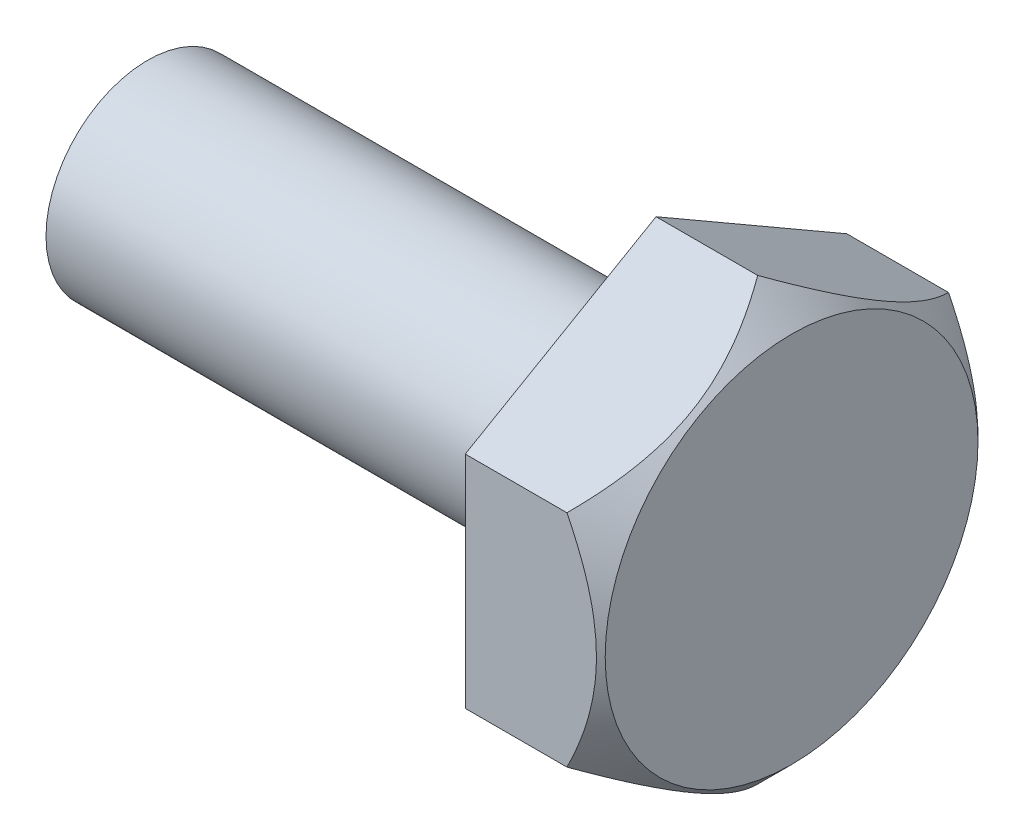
ISO-10303-21;
HEADER;
FILE_DESCRIPTION(('STEP AP214'),'2;1');
FILE_NAME('part.step','',(''),(''),'','','');
FILE_SCHEMA(('AUTOMOTIVE_DESIGN { 1 0 10303 214 1 1 1 1 }'));
ENDSEC;
DATA;
#1=APPLICATION_CONTEXT('core data for automotive mechanical design processes');
#2=APPLICATION_PROTOCOL_DEFINITION('international standard','automotive_design',2000,#1);
#3=PRODUCT_CONTEXT('',#1,'mechanical');
#4=PRODUCT('Part','Part','',(#3));
#5=PRODUCT_RELATED_PRODUCT_CATEGORY('part','',(#4));
#6=PRODUCT_DEFINITION_FORMATION('','',#4);
#7=PRODUCT_DEFINITION_CONTEXT('part definition',#1,'design');
#8=PRODUCT_DEFINITION('design','',#6,#7);
#9=PRODUCT_DEFINITION_SHAPE('','',#8);
#10=(LENGTH_UNIT() NAMED_UNIT(*) SI_UNIT(.MILLI.,.METRE.));
#11=(NAMED_UNIT(*) PLANE_ANGLE_UNIT() SI_UNIT($,.RADIAN.));
#12=(NAMED_UNIT(*) SI_UNIT($,.STERADIAN.) SOLID_ANGLE_UNIT());
#13=UNCERTAINTY_MEASURE_WITH_UNIT(LENGTH_MEASURE(1.E-05),#10,'distance_accuracy_value','');
#14=(GEOMETRIC_REPRESENTATION_CONTEXT(3) GLOBAL_UNCERTAINTY_ASSIGNED_CONTEXT((#13)) GLOBAL_UNIT_ASSIGNED_CONTEXT((#10,
#11,#12)) REPRESENTATION_CONTEXT('',''));
#15=CARTESIAN_POINT('',(0.,0.,0.));
#16=DIRECTION('',(0.,0.,1.));
#17=DIRECTION('',(1.,0.,0.));
#18=AXIS2_PLACEMENT_3D('',#15,#16,#17);
#19=CARTESIAN_POINT('',(-4.,3.,0.));
#20=DIRECTION('',(1.,0.,0.));
#21=DIRECTION('',(0.,0.,-1.));
#22=AXIS2_PLACEMENT_3D('',#19,#20,#21);
#23=PLANE('',#22);
#24=CARTESIAN_POINT('',(-4.,0.,0.));
#25=DIRECTION('',(-1.,0.,0.));
#26=DIRECTION('',(0.,0.,1.));
#27=AXIS2_PLACEMENT_3D('',#24,#25,#26);
#28=CIRCLE('',#27,3.);
#29=CARTESIAN_POINT('',(-4.,0.,3.));
#30=VERTEX_POINT('',#29);
#31=EDGE_CURVE('E117',#30,#30,#28,.T.);
#32=ORIENTED_EDGE('',*,*,#31,.F.);
#33=EDGE_LOOP('',(#32));
#34=FACE_BOUND('',#33,.T.);
#35=DIRECTION('',(0.,0.499999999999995,0.866025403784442));
#36=VECTOR('',#35,1.);
#37=CARTESIAN_POINT('',(-4.,5.62500000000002,-1.51554445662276));
#38=LINE('',#37,#36);
#39=CARTESIAN_POINT('',(-4.,3.25000000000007,-5.62916512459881));
#40=VERTEX_POINT('',#39);
#41=CARTESIAN_POINT('',(-4.,6.5,0.));
#42=VERTEX_POINT('',#41);
#43=EDGE_CURVE('E115',#40,#42,#38,.T.);
#44=ORIENTED_EDGE('',*,*,#43,.F.);
#45=DIRECTION('',(0.,1.,0.));
#46=VECTOR('',#45,1.);
#47=CARTESIAN_POINT('',(-4.,3.00000000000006,-5.62916512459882));
#48=LINE('',#47,#46);
#49=CARTESIAN_POINT('',(-4.,-3.24999999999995,-5.62916512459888));
#50=VERTEX_POINT('',#49);
#51=EDGE_CURVE('E113',#50,#40,#48,.T.);
#52=ORIENTED_EDGE('',*,*,#51,.F.);
#53=DIRECTION('',(0.,0.500000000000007,-0.866025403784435));
#54=VECTOR('',#53,1.);
#55=CARTESIAN_POINT('',(-4.,-4.12499999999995,-4.11362066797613));
#56=LINE('',#55,#54);
#57=CARTESIAN_POINT('',(-4.,-6.5,0.));
#58=VERTEX_POINT('',#57);
#59=EDGE_CURVE('E108',#58,#50,#56,.T.);
#60=ORIENTED_EDGE('',*,*,#59,.F.);
#61=DIRECTION('',(0.,-0.499999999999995,-0.866025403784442));
#62=VECTOR('',#61,1.);
#63=CARTESIAN_POINT('',(-4.,-4.12500000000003,4.11362066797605));
#64=LINE('',#63,#62);
#65=CARTESIAN_POINT('',(-4.,-3.25000000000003,5.62916512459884));
#66=VERTEX_POINT('',#65);
#67=EDGE_CURVE('E106',#66,#58,#64,.T.);
#68=ORIENTED_EDGE('',*,*,#67,.F.);
#69=DIRECTION('',(0.,-1.,0.));
#70=VECTOR('',#69,1.);
#71=CARTESIAN_POINT('',(-4.,2.99999999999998,5.62916512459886));
#72=LINE('',#71,#70);
#73=CARTESIAN_POINT('',(-4.,3.24999999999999,5.62916512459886));
#74=VERTEX_POINT('',#73);
#75=EDGE_CURVE('E92',#74,#66,#72,.T.);
#76=ORIENTED_EDGE('',*,*,#75,.F.);
#77=DIRECTION('',(0.,-0.500000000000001,0.866025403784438));
#78=VECTOR('',#77,1.);
#79=CARTESIAN_POINT('',(-4.,5.625,1.51554445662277));
#80=LINE('',#79,#78);
#81=EDGE_CURVE('E87',#42,#74,#80,.T.);
#82=ORIENTED_EDGE('',*,*,#81,.F.);
#83=EDGE_LOOP('',(#44,#52,#60,#68,#76,#82));
#84=FACE_BOUND('',#83,.T.);
#85=ADVANCED_FACE('F32',(#34,#84),#23,.F.);
#86=CARTESIAN_POINT('',(-19.,0.,0.));
#87=DIRECTION('',(1.,0.,0.));
#88=DIRECTION('',(0.,0.,-1.));
#89=AXIS2_PLACEMENT_3D('',#86,#87,#88);
#90=PLANE('',#89);
#91=CARTESIAN_POINT('',(-19.,0.,0.));
#92=DIRECTION('',(-1.,0.,0.));
#93=DIRECTION('',(0.,0.,1.));
#94=AXIS2_PLACEMENT_3D('',#91,#92,#93);
#95=CIRCLE('',#94,3.);
#96=CARTESIAN_POINT('',(-19.,0.,3.));
#97=VERTEX_POINT('',#96);
#98=EDGE_CURVE('E120',#97,#97,#95,.T.);
#99=ORIENTED_EDGE('',*,*,#98,.T.);
#100=EDGE_LOOP('',(#99));
#101=FACE_BOUND('',#100,.T.);
#102=ADVANCED_FACE('F151',(#101),#90,.F.);
#103=CARTESIAN_POINT('',(0.,0.,0.));
#104=DIRECTION('',(-1.,0.,0.));
#105=DIRECTION('',(0.,0.,1.));
#106=AXIS2_PLACEMENT_3D('',#103,#104,#105);
#107=CYLINDRICAL_SURFACE('',#106,3.);
#108=ORIENTED_EDGE('',*,*,#98,.F.);
#109=EDGE_LOOP('',(#108));
#110=FACE_BOUND('',#109,.T.);
#111=ORIENTED_EDGE('',*,*,#31,.T.);
#112=EDGE_LOOP('',(#111));
#113=FACE_BOUND('',#112,.T.);
#114=ADVANCED_FACE('F147',(#110,#113),#107,.T.);
#115=CARTESIAN_POINT('',(-10.,3.25000000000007,-5.62916512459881));
#116=DIRECTION('',(0.,0.866025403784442,-0.499999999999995));
#117=DIRECTION('',(0.,0.499999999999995,0.866025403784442));
#118=AXIS2_PLACEMENT_3D('',#115,#116,#117);
#119=PLANE('',#118);
#120=ORIENTED_EDGE('',*,*,#43,.T.);
#121=DIRECTION('',(1.,0.,0.));
#122=VECTOR('',#121,1.);
#123=CARTESIAN_POINT('',(-10.,6.5,0.));
#124=LINE('',#123,#122);
#125=CARTESIAN_POINT('',(-1.,6.5,0.));
#126=VERTEX_POINT('',#125);
#127=EDGE_CURVE('E52',#42,#126,#124,.T.);
#128=ORIENTED_EDGE('',*,*,#127,.T.);
#129=CARTESIAN_POINT('',(-1.00011547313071,3.24988452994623,-5.62936512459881));
#130=CARTESIAN_POINT('',(-0.94423902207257,3.30576639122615,-5.53257490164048));
#131=CARTESIAN_POINT('',(-0.890077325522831,3.36207778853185,-5.4350407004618));
#132=CARTESIAN_POINT('',(-0.785705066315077,3.47564392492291,-5.23833838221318));
#133=CARTESIAN_POINT('',(-0.735496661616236,3.53289915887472,-5.13916940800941));
#134=CARTESIAN_POINT('',(-0.591155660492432,3.70673894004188,-4.83807007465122));
#135=CARTESIAN_POINT('',(-0.503923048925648,3.82479513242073,-4.63359075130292));
#136=CARTESIAN_POINT('',(-0.354543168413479,4.06286489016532,-4.22124183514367));
#137=CARTESIAN_POINT('',(-0.292019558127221,4.18281760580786,-4.01347763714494));
#138=CARTESIAN_POINT('',(-0.219695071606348,4.36471875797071,-3.69841559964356));
#139=CARTESIAN_POINT('',(-0.199173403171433,4.42562028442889,-3.59293106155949));
#140=CARTESIAN_POINT('',(-0.16574809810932,4.54793900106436,-3.38106882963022));
#141=CARTESIAN_POINT('',(-0.152843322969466,4.60935611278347,-3.2746912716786));
#142=CARTESIAN_POINT('',(-0.131206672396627,4.75902065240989,-3.01546468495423));
#143=CARTESIAN_POINT('',(-0.126666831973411,4.84742933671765,-2.86233635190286));
#144=CARTESIAN_POINT('',(-0.134286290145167,5.0240873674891,-2.55635566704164));
#145=CARTESIAN_POINT('',(-0.146451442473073,5.11233664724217,-2.40350343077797));
#146=CARTESIAN_POINT('',(-0.186763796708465,5.28800321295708,-2.0992400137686));
#147=CARTESIAN_POINT('',(-0.214928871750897,5.37541945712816,-1.94783063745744));
#148=CARTESIAN_POINT('',(-0.285709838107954,5.54874947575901,-1.64761423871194));
#149=CARTESIAN_POINT('',(-0.328324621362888,5.63466336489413,-1.49880701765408));
#150=CARTESIAN_POINT('',(-0.415996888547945,5.78717685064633,-1.23464591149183));
#151=CARTESIAN_POINT('',(-0.45874873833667,5.85411414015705,-1.11870712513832));
#152=CARTESIAN_POINT('',(-0.551141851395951,5.98678709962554,-0.888910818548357));
#153=CARTESIAN_POINT('',(-0.600783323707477,6.05252273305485,-0.775053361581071));
#154=CARTESIAN_POINT('',(-0.705842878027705,6.18258533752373,-0.549778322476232));
#155=CARTESIAN_POINT('',(-0.761242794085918,6.2469160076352,-0.438354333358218));
#156=CARTESIAN_POINT('',(-0.87709187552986,6.37438610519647,-0.217569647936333));
#157=CARTESIAN_POINT('',(-0.937537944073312,6.43752623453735,-0.108207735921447));
#158=CARTESIAN_POINT('',(-1.00011547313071,6.50011547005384,0.000199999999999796));
#159=B_SPLINE_CURVE_WITH_KNOTS('',3,(#129,#130,#131,#132,#133,#134,#135,#136,#137,#138,#139,
#140,#141,#142,#143,#144,#145,#146,#147,#148,#149,#150,#151,#152,#153,#154,#155,#156,#157,#158),
.UNSPECIFIED.,.F.,.F.,(4,2,2,2,2,2,2,2,2,2,2,2,2,2,4),(0.,0.374837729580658,0.749878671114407,
1.50400966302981,2.24616559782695,2.61651570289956,2.98681043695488,3.51661288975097,
4.04660104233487,4.57718239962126,5.10772307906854,5.52913066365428,5.9505510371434,
6.37068015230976,6.79055330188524),.UNSPECIFIED.);
#160=CARTESIAN_POINT('',(-1.,3.25000000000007,-5.62916512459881));
#161=VERTEX_POINT('',#160);
#162=EDGE_CURVE('E12',#161,#126,#159,.T.);
#163=ORIENTED_EDGE('',*,*,#162,.F.);
#164=DIRECTION('',(1.,0.,0.));
#165=VECTOR('',#164,1.);
#166=CARTESIAN_POINT('',(-10.,3.25000000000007,-5.62916512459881));
#167=LINE('',#166,#165);
#168=EDGE_CURVE('E93',#40,#161,#167,.T.);
#169=ORIENTED_EDGE('',*,*,#168,.F.);
#170=EDGE_LOOP('',(#120,#128,#163,#169));
#171=FACE_BOUND('',#170,.T.);
#172=ADVANCED_FACE('F142',(#171),#119,.T.);
#173=CARTESIAN_POINT('',(-10.,-3.24999999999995,-5.62916512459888));
#174=DIRECTION('',(0.,0.,-1.));
#175=DIRECTION('',(0.,1.,0.));
#176=AXIS2_PLACEMENT_3D('',#173,#174,#175);
#177=PLANE('',#176);
#178=ORIENTED_EDGE('',*,*,#51,.T.);
#179=ORIENTED_EDGE('',*,*,#168,.T.);
#180=CARTESIAN_POINT('',(-3.27419536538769,-6.73045349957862,-5.62916512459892));
#181=CARTESIAN_POINT('',(-3.1493384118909,-6.56764635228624,-5.62916512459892));
#182=CARTESIAN_POINT('',(-3.02561479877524,-6.40395608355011,-5.62916512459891));
#183=CARTESIAN_POINT('',(-2.78095028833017,-6.0744504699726,-5.62916512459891));
#184=CARTESIAN_POINT('',(-2.66001006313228,-5.90863462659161,-5.62916512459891));
#185=CARTESIAN_POINT('',(-2.42056758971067,-5.57330676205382,-5.6291651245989));
#186=CARTESIAN_POINT('',(-2.3020913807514,-5.40377608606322,-5.6291651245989));
#187=CARTESIAN_POINT('',(-2.06931142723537,-5.06188319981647,-5.6291651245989));
#188=CARTESIAN_POINT('',(-1.95500739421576,-4.88952118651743,-5.6291651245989));
#189=CARTESIAN_POINT('',(-1.72455454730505,-4.53064916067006,-5.6291651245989));
#190=CARTESIAN_POINT('',(-1.60873467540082,-4.34392684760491,-5.62916512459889));
#191=CARTESIAN_POINT('',(-1.3843551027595,-3.96610092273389,-5.62916512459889));
#192=CARTESIAN_POINT('',(-1.27579661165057,-3.77499658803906,-5.62916512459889));
#193=CARTESIAN_POINT('',(-1.06825702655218,-3.38836628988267,-5.62916512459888));
#194=CARTESIAN_POINT('',(-0.969247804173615,-3.19285554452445,-5.62916512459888));
#195=CARTESIAN_POINT('',(-0.783024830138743,-2.79633950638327,-5.62916512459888));
#196=CARTESIAN_POINT('',(-0.695805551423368,-2.59533684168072,-5.62916512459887));
#197=CARTESIAN_POINT('',(-0.543946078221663,-2.20693844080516,-5.62916512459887));
#198=CARTESIAN_POINT('',(-0.477944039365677,-2.02008065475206,-5.62916512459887));
#199=CARTESIAN_POINT('',(-0.360901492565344,-1.64164893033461,-5.62916512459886));
#200=CARTESIAN_POINT('',(-0.309861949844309,-1.45007468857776,-5.62916512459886));
#201=CARTESIAN_POINT('',(-0.226340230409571,-1.0666642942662,-5.62916512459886));
#202=CARTESIAN_POINT('',(-0.193524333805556,-0.874902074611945,-5.62916512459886));
#203=CARTESIAN_POINT('',(-0.147126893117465,-0.489051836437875,-5.62916512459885));
#204=CARTESIAN_POINT('',(-0.133541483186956,-0.294964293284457,-5.62916512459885));
#205=CARTESIAN_POINT('',(-0.126737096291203,0.0853451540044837,-5.62916512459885));
#206=CARTESIAN_POINT('',(-0.13268036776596,0.271552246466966,-5.62916512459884));
#207=CARTESIAN_POINT('',(-0.162693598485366,0.642489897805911,-5.62916512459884));
#208=CARTESIAN_POINT('',(-0.186765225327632,0.827220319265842,-5.62916512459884));
#209=CARTESIAN_POINT('',(-0.25209148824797,1.19699673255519,-5.62916512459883));
#210=CARTESIAN_POINT('',(-0.293647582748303,1.38198856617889,-5.62916512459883));
#211=CARTESIAN_POINT('',(-0.391652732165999,1.74790655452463,-5.62916512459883));
#212=CARTESIAN_POINT('',(-0.448100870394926,1.92883295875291,-5.62916512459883));
#213=CARTESIAN_POINT('',(-0.57740433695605,2.29761840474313,-5.62916512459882));
#214=CARTESIAN_POINT('',(-0.651073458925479,2.4851889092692,-5.62916512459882));
#215=CARTESIAN_POINT('',(-0.80978292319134,2.85549848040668,-5.62916512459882));
#216=CARTESIAN_POINT('',(-0.894828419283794,3.03823531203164,-5.62916512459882));
#217=CARTESIAN_POINT('',(-1.0742729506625,3.39974500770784,-5.62916512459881));
#218=CARTESIAN_POINT('',(-1.16870088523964,3.57850340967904,-5.62916512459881));
#219=CARTESIAN_POINT('',(-1.36483089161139,3.93192150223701,-5.62916512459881));
#220=CARTESIAN_POINT('',(-1.46653183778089,4.10658182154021,-5.6291651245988));
#221=CARTESIAN_POINT('',(-1.67061481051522,4.44379608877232,-5.6291651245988));
#222=CARTESIAN_POINT('',(-1.77271468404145,4.60652170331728,-5.6291651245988));
#223=CARTESIAN_POINT('',(-1.98125285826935,4.92917744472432,-5.6291651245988));
#224=CARTESIAN_POINT('',(-2.08769148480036,5.0891073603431,-5.62916512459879));
#225=CARTESIAN_POINT('',(-2.30326475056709,5.405249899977,-5.62916512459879));
#226=CARTESIAN_POINT('',(-2.41237081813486,5.5614820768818,-5.62916512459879));
#227=CARTESIAN_POINT('',(-2.63350206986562,5.87180427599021,-5.62916512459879));
#228=CARTESIAN_POINT('',(-2.74552644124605,6.02589487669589,-5.62916512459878));
#229=CARTESIAN_POINT('',(-2.85874514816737,6.17908734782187,-5.62916512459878));
#230=B_SPLINE_CURVE_WITH_KNOTS('',3,(#180,#181,#182,#183,#184,#185,#186,#187,#188,#189,#190,
#191,#192,#193,#194,#195,#196,#197,#198,#199,#200,#201,#202,#203,#204,#205,#206,#207,#208,#209,
#210,#211,#212,#213,#214,#215,#216,#217,#218,#219,#220,#221,#222,#223,#224,#225,#226,#227,#228,
#229),.UNSPECIFIED.,.F.,.F.,(4,2,2,2,2,2,2,2,2,2,2,2,2,2,2,2,2,2,2,2,2,2,2,2,4),(0.,
0.615526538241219,1.23120018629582,1.85162829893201,2.47201343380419,3.13105980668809,
3.79021569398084,4.4473665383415,5.10420823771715,5.69820994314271,6.29224995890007,
6.87501911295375,7.45767109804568,8.0156599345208,8.57370010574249,9.14178375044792,
9.7098324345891,10.3139245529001,10.918291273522,11.5245809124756,12.130776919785,
12.7070087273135,13.2832838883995,13.8549237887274,14.4264061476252),.UNSPECIFIED.);
#231=CARTESIAN_POINT('',(-1.,-3.24999999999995,-5.62916512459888));
#232=VERTEX_POINT('',#231);
#233=EDGE_CURVE('E45',#232,#161,#230,.T.);
#234=ORIENTED_EDGE('',*,*,#233,.F.);
#235=DIRECTION('',(1.,0.,0.));
#236=VECTOR('',#235,1.);
#237=CARTESIAN_POINT('',(-10.,-3.24999999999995,-5.62916512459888));
#238=LINE('',#237,#236);
#239=EDGE_CURVE('E203',#50,#232,#238,.T.);
#240=ORIENTED_EDGE('',*,*,#239,.F.);
#241=EDGE_LOOP('',(#178,#179,#234,#240));
#242=FACE_BOUND('',#241,.T.);
#243=ADVANCED_FACE('F146',(#242),#177,.T.);
#244=CARTESIAN_POINT('',(-10.,-6.5,0.));
#245=DIRECTION('',(0.,-0.866025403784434,-0.500000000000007));
#246=DIRECTION('',(0.,0.500000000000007,-0.866025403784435));
#247=AXIS2_PLACEMENT_3D('',#244,#245,#246);
#248=PLANE('',#247);
#249=ORIENTED_EDGE('',*,*,#59,.T.);
#250=ORIENTED_EDGE('',*,*,#239,.T.);
#251=CARTESIAN_POINT('',(-1.00011547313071,-6.50011547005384,0.000199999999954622));
#252=CARTESIAN_POINT('',(-0.944239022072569,-6.44423360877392,-0.0965902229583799));
#253=CARTESIAN_POINT('',(-0.890077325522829,-6.38792221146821,-0.194124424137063));
#254=CARTESIAN_POINT('',(-0.785705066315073,-6.27435607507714,-0.390826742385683));
#255=CARTESIAN_POINT('',(-0.73549666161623,-6.21710084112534,-0.489995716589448));
#256=CARTESIAN_POINT('',(-0.591155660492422,-6.04326105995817,-0.791095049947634));
#257=CARTESIAN_POINT('',(-0.503923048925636,-5.92520486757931,-0.995574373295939));
#258=CARTESIAN_POINT('',(-0.354543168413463,-5.68713510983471,-1.40792328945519));
#259=CARTESIAN_POINT('',(-0.292019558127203,-5.56718239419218,-1.61568748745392));
#260=CARTESIAN_POINT('',(-0.219695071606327,-5.38528124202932,-1.93074952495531));
#261=CARTESIAN_POINT('',(-0.199173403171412,-5.32437971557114,-2.03623406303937));
#262=CARTESIAN_POINT('',(-0.165748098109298,-5.20206099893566,-2.24809629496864));
#263=CARTESIAN_POINT('',(-0.152843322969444,-5.14064388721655,-2.35447385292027));
#264=CARTESIAN_POINT('',(-0.131206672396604,-4.99097934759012,-2.61370043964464));
#265=CARTESIAN_POINT('',(-0.126666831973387,-4.90257066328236,-2.766828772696));
#266=CARTESIAN_POINT('',(-0.134286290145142,-4.7259126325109,-3.07280945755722));
#267=CARTESIAN_POINT('',(-0.146451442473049,-4.63766335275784,-3.22566169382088));
#268=CARTESIAN_POINT('',(-0.186763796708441,-4.46199678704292,-3.52992511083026));
#269=CARTESIAN_POINT('',(-0.214928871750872,-4.37458054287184,-3.68133448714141));
#270=CARTESIAN_POINT('',(-0.285709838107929,-4.20125052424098,-3.9815508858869));
#271=CARTESIAN_POINT('',(-0.328324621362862,-4.11533663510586,-4.13035810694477));
#272=CARTESIAN_POINT('',(-0.41599688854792,-3.96282314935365,-4.39451921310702));
#273=CARTESIAN_POINT('',(-0.458748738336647,-3.89588585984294,-4.51045799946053));
#274=CARTESIAN_POINT('',(-0.551141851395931,-3.76321290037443,-4.7402543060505));
#275=CARTESIAN_POINT('',(-0.60078332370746,-3.69747726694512,-4.85411176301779));
#276=CARTESIAN_POINT('',(-0.705842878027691,-3.56741466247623,-5.07938680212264));
#277=CARTESIAN_POINT('',(-0.761242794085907,-3.50308399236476,-5.19081079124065));
#278=CARTESIAN_POINT('',(-0.877091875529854,-3.37561389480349,-5.41159547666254));
#279=CARTESIAN_POINT('',(-0.937537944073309,-3.3124737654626,-5.52095738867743));
#280=CARTESIAN_POINT('',(-1.00011547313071,-3.24988452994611,-5.62936512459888));
#281=B_SPLINE_CURVE_WITH_KNOTS('',3,(#251,#252,#253,#254,#255,#256,#257,#258,#259,#260,#261,
#262,#263,#264,#265,#266,#267,#268,#269,#270,#271,#272,#273,#274,#275,#276,#277,#278,#279,#280),
.UNSPECIFIED.,.F.,.F.,(4,2,2,2,2,2,2,2,2,2,2,2,2,2,4),(0.,0.374837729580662,0.749878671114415,
1.50400966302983,2.24616559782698,2.61651570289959,2.98681043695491,3.51661288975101,
4.0466010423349,4.57718239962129,5.10772307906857,5.52913066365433,5.95055103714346,
6.37068015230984,6.79055330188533),.UNSPECIFIED.);
#282=CARTESIAN_POINT('',(-1.,-6.5,0.));
#283=VERTEX_POINT('',#282);
#284=EDGE_CURVE('E169',#283,#232,#281,.T.);
#285=ORIENTED_EDGE('',*,*,#284,.F.);
#286=DIRECTION('',(1.,0.,0.));
#287=VECTOR('',#286,1.);
#288=CARTESIAN_POINT('',(-10.,-6.5,0.));
#289=LINE('',#288,#287);
#290=EDGE_CURVE('E200',#58,#283,#289,.T.);
#291=ORIENTED_EDGE('',*,*,#290,.F.);
#292=EDGE_LOOP('',(#249,#250,#285,#291));
#293=FACE_BOUND('',#292,.T.);
#294=ADVANCED_FACE('F186',(#293),#248,.T.);
#295=CARTESIAN_POINT('',(-10.,-3.25000000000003,5.62916512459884));
#296=DIRECTION('',(0.,-0.866025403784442,0.499999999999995));
#297=DIRECTION('',(0.,-0.499999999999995,-0.866025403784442));
#298=AXIS2_PLACEMENT_3D('',#295,#296,#297);
#299=PLANE('',#298);
#300=ORIENTED_EDGE('',*,*,#67,.T.);
#301=ORIENTED_EDGE('',*,*,#290,.T.);
#302=CARTESIAN_POINT('',(-1.00011547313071,-3.24988452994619,5.62936512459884));
#303=CARTESIAN_POINT('',(-0.944239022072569,-3.30576639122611,5.5325749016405));
#304=CARTESIAN_POINT('',(-0.890077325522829,-3.36207778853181,5.43504070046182));
#305=CARTESIAN_POINT('',(-0.785705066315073,-3.47564392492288,5.23833838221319));
#306=CARTESIAN_POINT('',(-0.73549666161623,-3.53289915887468,5.13916940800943));
#307=CARTESIAN_POINT('',(-0.591155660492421,-3.70673894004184,4.83807007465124));
#308=CARTESIAN_POINT('',(-0.503923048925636,-3.8247951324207,4.63359075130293));
#309=CARTESIAN_POINT('',(-0.354543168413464,-4.06286489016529,4.22124183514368));
#310=CARTESIAN_POINT('',(-0.292019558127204,-4.18281760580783,4.01347763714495));
#311=CARTESIAN_POINT('',(-0.219695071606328,-4.36471875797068,3.69841559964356));
#312=CARTESIAN_POINT('',(-0.199173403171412,-4.42562028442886,3.59293106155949));
#313=CARTESIAN_POINT('',(-0.165748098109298,-4.54793900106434,3.38106882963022));
#314=CARTESIAN_POINT('',(-0.152843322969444,-4.60935611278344,3.27469127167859));
#315=CARTESIAN_POINT('',(-0.131206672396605,-4.75902065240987,3.01546468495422));
#316=CARTESIAN_POINT('',(-0.126666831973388,-4.84742933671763,2.86233635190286));
#317=CARTESIAN_POINT('',(-0.134286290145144,-5.02408736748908,2.55635566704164));
#318=CARTESIAN_POINT('',(-0.14645144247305,-5.11233664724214,2.40350343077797));
#319=CARTESIAN_POINT('',(-0.186763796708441,-5.28800321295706,2.09924001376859));
#320=CARTESIAN_POINT('',(-0.214928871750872,-5.37541945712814,1.94783063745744));
#321=CARTESIAN_POINT('',(-0.285709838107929,-5.54874947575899,1.64761423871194));
#322=CARTESIAN_POINT('',(-0.328324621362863,-5.6346633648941,1.49880701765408));
#323=CARTESIAN_POINT('',(-0.415996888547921,-5.78717685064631,1.23464591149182));
#324=CARTESIAN_POINT('',(-0.458748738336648,-5.85411414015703,1.11870712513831));
#325=CARTESIAN_POINT('',(-0.551141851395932,-5.98678709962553,0.888910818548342));
#326=CARTESIAN_POINT('',(-0.60078332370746,-6.05252273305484,0.775053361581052));
#327=CARTESIAN_POINT('',(-0.705842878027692,-6.18258533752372,0.549778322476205));
#328=CARTESIAN_POINT('',(-0.761242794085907,-6.24691600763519,0.438354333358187));
#329=CARTESIAN_POINT('',(-0.877091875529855,-6.37438610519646,0.217569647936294));
#330=CARTESIAN_POINT('',(-0.93753794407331,-6.43752623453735,0.108207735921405));
#331=CARTESIAN_POINT('',(-1.00011547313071,-6.50011547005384,-0.000200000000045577));
#332=B_SPLINE_CURVE_WITH_KNOTS('',3,(#302,#303,#304,#305,#306,#307,#308,#309,#310,#311,#312,
#313,#314,#315,#316,#317,#318,#319,#320,#321,#322,#323,#324,#325,#326,#327,#328,#329,#330,#331),
.UNSPECIFIED.,.F.,.F.,(4,2,2,2,2,2,2,2,2,2,2,2,2,2,4),(0.,0.374837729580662,0.749878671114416,
1.50400966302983,2.24616559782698,2.61651570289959,2.98681043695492,3.51661288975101,
4.0466010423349,4.57718239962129,5.10772307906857,5.52913066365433,5.95055103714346,
6.37068015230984,6.79055330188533),.UNSPECIFIED.);
#333=CARTESIAN_POINT('',(-1.,-3.25000000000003,5.62916512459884));
#334=VERTEX_POINT('',#333);
#335=EDGE_CURVE('E174',#334,#283,#332,.T.);
#336=ORIENTED_EDGE('',*,*,#335,.F.);
#337=DIRECTION('',(1.,0.,0.));
#338=VECTOR('',#337,1.);
#339=CARTESIAN_POINT('',(-10.,-3.25000000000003,5.62916512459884));
#340=LINE('',#339,#338);
#341=EDGE_CURVE('E102',#66,#334,#340,.T.);
#342=ORIENTED_EDGE('',*,*,#341,.F.);
#343=EDGE_LOOP('',(#300,#301,#336,#342));
#344=FACE_BOUND('',#343,.T.);
#345=ADVANCED_FACE('F189',(#344),#299,.T.);
#346=CARTESIAN_POINT('',(-10.,3.24999999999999,5.62916512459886));
#347=DIRECTION('',(0.,0.,1.));
#348=DIRECTION('',(0.,-1.,0.));
#349=AXIS2_PLACEMENT_3D('',#346,#347,#348);
#350=PLANE('',#349);
#351=ORIENTED_EDGE('',*,*,#75,.T.);
#352=ORIENTED_EDGE('',*,*,#341,.T.);
#353=CARTESIAN_POINT('',(-3.27419536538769,-6.7304534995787,5.62916512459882));
#354=CARTESIAN_POINT('',(-3.1493384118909,-6.56764635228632,5.62916512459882));
#355=CARTESIAN_POINT('',(-3.02561479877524,-6.40395608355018,5.62916512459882));
#356=CARTESIAN_POINT('',(-2.78095028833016,-6.07445046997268,5.62916512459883));
#357=CARTESIAN_POINT('',(-2.66001006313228,-5.90863462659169,5.62916512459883));
#358=CARTESIAN_POINT('',(-2.42056758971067,-5.5733067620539,5.62916512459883));
#359=CARTESIAN_POINT('',(-2.3020913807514,-5.4037760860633,5.62916512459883));
#360=CARTESIAN_POINT('',(-2.06931142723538,-5.06188319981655,5.62916512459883));
#361=CARTESIAN_POINT('',(-1.95500739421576,-4.88952118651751,5.62916512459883));
#362=CARTESIAN_POINT('',(-1.72455454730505,-4.53064916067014,5.62916512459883));
#363=CARTESIAN_POINT('',(-1.60873467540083,-4.34392684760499,5.62916512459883));
#364=CARTESIAN_POINT('',(-1.3843551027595,-3.96610092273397,5.62916512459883));
#365=CARTESIAN_POINT('',(-1.27579661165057,-3.77499658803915,5.62916512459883));
#366=CARTESIAN_POINT('',(-1.06825702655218,-3.38836628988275,5.62916512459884));
#367=CARTESIAN_POINT('',(-0.969247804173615,-3.19285554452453,5.62916512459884));
#368=CARTESIAN_POINT('',(-0.783024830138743,-2.79633950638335,5.62916512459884));
#369=CARTESIAN_POINT('',(-0.695805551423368,-2.5953368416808,5.62916512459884));
#370=CARTESIAN_POINT('',(-0.543946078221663,-2.20693844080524,5.62916512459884));
#371=CARTESIAN_POINT('',(-0.477944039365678,-2.02008065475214,5.62916512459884));
#372=CARTESIAN_POINT('',(-0.360901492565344,-1.64164893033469,5.62916512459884));
#373=CARTESIAN_POINT('',(-0.309861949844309,-1.45007468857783,5.62916512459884));
#374=CARTESIAN_POINT('',(-0.226340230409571,-1.06666429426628,5.62916512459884));
#375=CARTESIAN_POINT('',(-0.193524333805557,-0.874902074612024,5.62916512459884));
#376=CARTESIAN_POINT('',(-0.147126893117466,-0.489051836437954,5.62916512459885));
#377=CARTESIAN_POINT('',(-0.133541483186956,-0.294964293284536,5.62916512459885));
#378=CARTESIAN_POINT('',(-0.126737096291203,0.0853451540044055,5.62916512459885));
#379=CARTESIAN_POINT('',(-0.13268036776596,0.271552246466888,5.62916512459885));
#380=CARTESIAN_POINT('',(-0.162693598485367,0.642489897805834,5.62916512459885));
#381=CARTESIAN_POINT('',(-0.186765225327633,0.827220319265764,5.62916512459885));
#382=CARTESIAN_POINT('',(-0.25209148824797,1.19699673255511,5.62916512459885));
#383=CARTESIAN_POINT('',(-0.293647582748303,1.38198856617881,5.62916512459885));
#384=CARTESIAN_POINT('',(-0.391652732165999,1.74790655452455,5.62916512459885));
#385=CARTESIAN_POINT('',(-0.448100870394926,1.92883295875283,5.62916512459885));
#386=CARTESIAN_POINT('',(-0.577404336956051,2.29761840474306,5.62916512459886));
#387=CARTESIAN_POINT('',(-0.651073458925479,2.48518890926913,5.62916512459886));
#388=CARTESIAN_POINT('',(-0.809782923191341,2.85549848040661,5.62916512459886));
#389=CARTESIAN_POINT('',(-0.894828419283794,3.03823531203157,5.62916512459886));
#390=CARTESIAN_POINT('',(-1.0742729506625,3.39974500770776,5.62916512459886));
#391=CARTESIAN_POINT('',(-1.16870088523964,3.57850340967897,5.62916512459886));
#392=CARTESIAN_POINT('',(-1.36483089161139,3.93192150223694,5.62916512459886));
#393=CARTESIAN_POINT('',(-1.46653183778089,4.10658182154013,5.62916512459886));
#394=CARTESIAN_POINT('',(-1.67061481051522,4.44379608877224,5.62916512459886));
#395=CARTESIAN_POINT('',(-1.77271468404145,4.6065217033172,5.62916512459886));
#396=CARTESIAN_POINT('',(-1.98125285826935,4.92917744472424,5.62916512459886));
#397=CARTESIAN_POINT('',(-2.08769148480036,5.08910736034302,5.62916512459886));
#398=CARTESIAN_POINT('',(-2.30326475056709,5.40524989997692,5.62916512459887));
#399=CARTESIAN_POINT('',(-2.41237081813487,5.56148207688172,5.62916512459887));
#400=CARTESIAN_POINT('',(-2.63350206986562,5.87180427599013,5.62916512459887));
#401=CARTESIAN_POINT('',(-2.74552644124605,6.02589487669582,5.62916512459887));
#402=CARTESIAN_POINT('',(-2.85874514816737,6.1790873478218,5.62916512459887));
#403=B_SPLINE_CURVE_WITH_KNOTS('',3,(#353,#354,#355,#356,#357,#358,#359,#360,#361,#362,#363,
#364,#365,#366,#367,#368,#369,#370,#371,#372,#373,#374,#375,#376,#377,#378,#379,#380,#381,#382,
#383,#384,#385,#386,#387,#388,#389,#390,#391,#392,#393,#394,#395,#396,#397,#398,#399,#400,#401,
#402),.UNSPECIFIED.,.F.,.F.,(4,2,2,2,2,2,2,2,2,2,2,2,2,2,2,2,2,2,2,2,2,2,2,2,4),(0.,
0.615526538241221,1.23120018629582,1.85162829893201,2.47201343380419,3.13105980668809,
3.79021569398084,4.4473665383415,5.10420823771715,5.69820994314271,6.29224995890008,
6.87501911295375,7.45767109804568,8.01565993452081,8.5737001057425,9.14178375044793,
9.70983243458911,10.3139245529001,10.918291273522,11.5245809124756,12.130776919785,
12.7070087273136,13.2832838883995,13.8549237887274,14.4264061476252),.UNSPECIFIED.);
#404=CARTESIAN_POINT('',(-1.,3.24999999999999,5.62916512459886));
#405=VERTEX_POINT('',#404);
#406=EDGE_CURVE('E100',#405,#334,#403,.F.);
#407=ORIENTED_EDGE('',*,*,#406,.F.);
#408=DIRECTION('',(1.,0.,0.));
#409=VECTOR('',#408,1.);
#410=CARTESIAN_POINT('',(-10.,3.24999999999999,5.62916512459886));
#411=LINE('',#410,#409);
#412=EDGE_CURVE('E57',#74,#405,#411,.T.);
#413=ORIENTED_EDGE('',*,*,#412,.F.);
#414=EDGE_LOOP('',(#351,#352,#407,#413));
#415=FACE_BOUND('',#414,.T.);
#416=ADVANCED_FACE('F96',(#415),#350,.T.);
#417=CARTESIAN_POINT('',(-10.,6.5,0.));
#418=DIRECTION('',(0.,0.866025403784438,0.500000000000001));
#419=DIRECTION('',(0.,-0.500000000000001,0.866025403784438));
#420=AXIS2_PLACEMENT_3D('',#417,#418,#419);
#421=PLANE('',#420);
#422=ORIENTED_EDGE('',*,*,#81,.T.);
#423=ORIENTED_EDGE('',*,*,#412,.T.);
#424=CARTESIAN_POINT('',(-1.00011547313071,6.50011547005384,-0.000200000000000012));
#425=CARTESIAN_POINT('',(-0.944239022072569,6.44423360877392,0.0965902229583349));
#426=CARTESIAN_POINT('',(-0.890077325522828,6.38792221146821,0.194124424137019));
#427=CARTESIAN_POINT('',(-0.785705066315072,6.27435607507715,0.390826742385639));
#428=CARTESIAN_POINT('',(-0.73549666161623,6.21710084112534,0.489995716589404));
#429=CARTESIAN_POINT('',(-0.591155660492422,6.04326105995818,0.791095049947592));
#430=CARTESIAN_POINT('',(-0.503923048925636,5.92520486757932,0.995574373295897));
#431=CARTESIAN_POINT('',(-0.354543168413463,5.68713510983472,1.40792328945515));
#432=CARTESIAN_POINT('',(-0.292019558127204,5.56718239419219,1.61568748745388));
#433=CARTESIAN_POINT('',(-0.219695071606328,5.38528124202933,1.93074952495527));
#434=CARTESIAN_POINT('',(-0.199173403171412,5.32437971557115,2.03623406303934));
#435=CARTESIAN_POINT('',(-0.165748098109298,5.20206099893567,2.2480962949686));
#436=CARTESIAN_POINT('',(-0.152843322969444,5.14064388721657,2.35447385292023));
#437=CARTESIAN_POINT('',(-0.131206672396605,4.99097934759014,2.6137004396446));
#438=CARTESIAN_POINT('',(-0.126666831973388,4.90257066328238,2.76682877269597));
#439=CARTESIAN_POINT('',(-0.134286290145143,4.72591263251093,3.07280945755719));
#440=CARTESIAN_POINT('',(-0.14645144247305,4.63766335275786,3.22566169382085));
#441=CARTESIAN_POINT('',(-0.186763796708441,4.46199678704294,3.52992511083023));
#442=CARTESIAN_POINT('',(-0.214928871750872,4.37458054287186,3.68133448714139));
#443=CARTESIAN_POINT('',(-0.285709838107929,4.20125052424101,3.98155088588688));
#444=CARTESIAN_POINT('',(-0.328324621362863,4.11533663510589,4.13035810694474));
#445=CARTESIAN_POINT('',(-0.415996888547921,3.96282314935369,4.394519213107));
#446=CARTESIAN_POINT('',(-0.458748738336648,3.89588585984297,4.51045799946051));
#447=CARTESIAN_POINT('',(-0.551141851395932,3.76321290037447,4.74025430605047));
#448=CARTESIAN_POINT('',(-0.60078332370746,3.69747726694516,4.85411176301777));
#449=CARTESIAN_POINT('',(-0.705842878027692,3.56741466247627,5.07938680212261));
#450=CARTESIAN_POINT('',(-0.761242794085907,3.5030839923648,5.19081079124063));
#451=CARTESIAN_POINT('',(-0.877091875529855,3.37561389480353,5.41159547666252));
#452=CARTESIAN_POINT('',(-0.93753794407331,3.31247376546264,5.52095738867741));
#453=CARTESIAN_POINT('',(-1.00011547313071,3.24988452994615,5.62936512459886));
#454=B_SPLINE_CURVE_WITH_KNOTS('',3,(#424,#425,#426,#427,#428,#429,#430,#431,#432,#433,#434,
#435,#436,#437,#438,#439,#440,#441,#442,#443,#444,#445,#446,#447,#448,#449,#450,#451,#452,#453),
.UNSPECIFIED.,.F.,.F.,(4,2,2,2,2,2,2,2,2,2,2,2,2,2,4),(0.,0.374837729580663,0.749878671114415,
1.50400966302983,2.24616559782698,2.61651570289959,2.98681043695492,3.51661288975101,
4.0466010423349,4.57718239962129,5.10772307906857,5.52913066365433,5.95055103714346,
6.37068015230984,6.79055330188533),.UNSPECIFIED.);
#455=EDGE_CURVE('E126',#126,#405,#454,.T.);
#456=ORIENTED_EDGE('',*,*,#455,.F.);
#457=ORIENTED_EDGE('',*,*,#127,.F.);
#458=EDGE_LOOP('',(#422,#423,#456,#457));
#459=FACE_BOUND('',#458,.T.);
#460=ADVANCED_FACE('F88',(#459),#421,.T.);
#461=CARTESIAN_POINT('',(0.,6.5,0.));
#462=DIRECTION('',(-1.,0.,0.));
#463=DIRECTION('',(0.,0.,1.));
#464=AXIS2_PLACEMENT_3D('',#461,#462,#463);
#465=PLANE('',#464);
#466=CARTESIAN_POINT('',(0.,0.,0.));
#467=DIRECTION('',(-1.,0.,0.));
#468=DIRECTION('',(0.,0.,1.));
#469=AXIS2_PLACEMENT_3D('',#466,#467,#468);
#470=CIRCLE('',#469,5.5);
#471=CARTESIAN_POINT('',(0.,0.,5.5));
#472=VERTEX_POINT('',#471);
#473=EDGE_CURVE('E123',#472,#472,#470,.F.);
#474=ORIENTED_EDGE('',*,*,#473,.T.);
#475=EDGE_LOOP('',(#474));
#476=FACE_BOUND('',#475,.T.);
#477=ADVANCED_FACE('F139',(#476),#465,.F.);
#478=CARTESIAN_POINT('',(-1.,0.,0.));
#479=DIRECTION('',(-1.,0.,0.));
#480=DIRECTION('',(0.,0.,1.));
#481=AXIS2_PLACEMENT_3D('',#478,#479,#480);
#482=CONICAL_SURFACE('',#481,6.5,0.785398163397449);
#483=ORIENTED_EDGE('',*,*,#473,.F.);
#484=EDGE_LOOP('',(#483));
#485=FACE_BOUND('',#484,.T.);
#486=ORIENTED_EDGE('',*,*,#233,.T.);
#487=ORIENTED_EDGE('',*,*,#162,.T.);
#488=ORIENTED_EDGE('',*,*,#455,.T.);
#489=ORIENTED_EDGE('',*,*,#406,.T.);
#490=ORIENTED_EDGE('',*,*,#335,.T.);
#491=ORIENTED_EDGE('',*,*,#284,.T.);
#492=EDGE_LOOP('',(#486,#487,#488,#489,#490,#491));
#493=FACE_BOUND('',#492,.T.);
#494=ADVANCED_FACE('F34',(#485,#493),#482,.T.);
#495=CLOSED_SHELL('',(#85,#102,#114,#172,#243,#294,#345,#416,#460,#477,#494));
#496=MANIFOLD_SOLID_BREP('B2',#495);
#497=ADVANCED_BREP_SHAPE_REPRESENTATION('',(#18,#496),#14);
#498=SHAPE_DEFINITION_REPRESENTATION(#9,#497);
ENDSEC;
END-ISO-10303-21;
